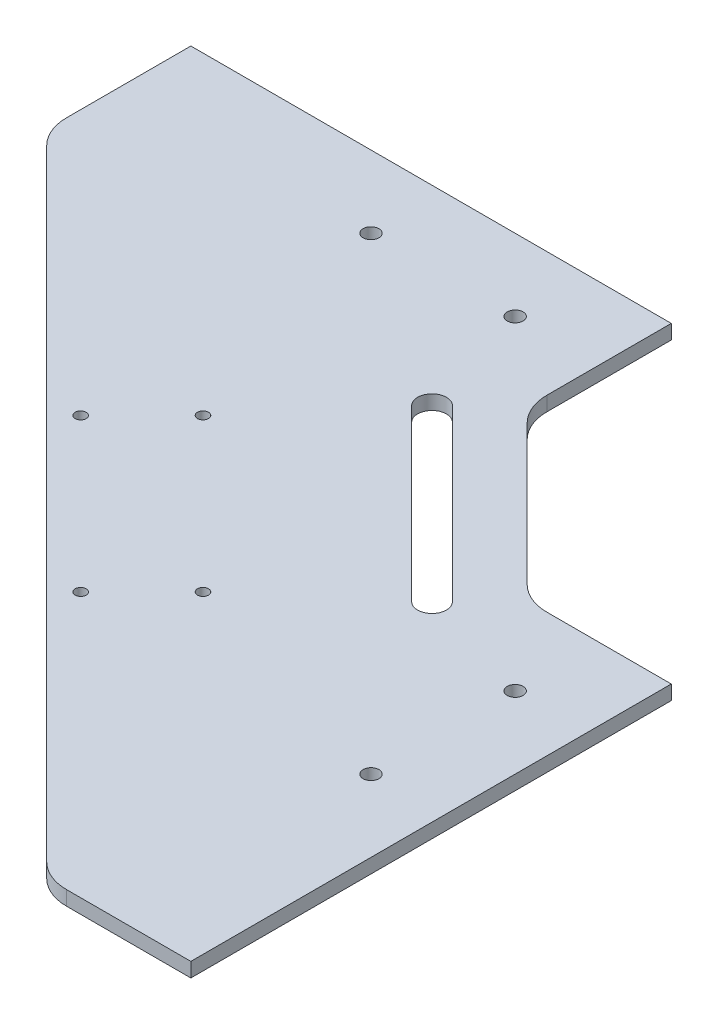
ISO-10303-21;
HEADER;
FILE_DESCRIPTION(('STEP AP214'),'2;1');
FILE_NAME('part.step','',(''),(''),'','','');
FILE_SCHEMA(('AUTOMOTIVE_DESIGN { 1 0 10303 214 1 1 1 1 }'));
ENDSEC;
DATA;
#1=APPLICATION_CONTEXT('core data for automotive mechanical design processes');
#2=APPLICATION_PROTOCOL_DEFINITION('international standard','automotive_design',2000,#1);
#3=PRODUCT_CONTEXT('',#1,'mechanical');
#4=PRODUCT('Part','Part','',(#3));
#5=PRODUCT_RELATED_PRODUCT_CATEGORY('part','',(#4));
#6=PRODUCT_DEFINITION_FORMATION('','',#4);
#7=PRODUCT_DEFINITION_CONTEXT('part definition',#1,'design');
#8=PRODUCT_DEFINITION('design','',#6,#7);
#9=PRODUCT_DEFINITION_SHAPE('','',#8);
#10=(LENGTH_UNIT() NAMED_UNIT(*) SI_UNIT(.MILLI.,.METRE.));
#11=(NAMED_UNIT(*) PLANE_ANGLE_UNIT() SI_UNIT($,.RADIAN.));
#12=(NAMED_UNIT(*) SI_UNIT($,.STERADIAN.) SOLID_ANGLE_UNIT());
#13=UNCERTAINTY_MEASURE_WITH_UNIT(LENGTH_MEASURE(1.E-05),#10,'distance_accuracy_value','');
#14=(GEOMETRIC_REPRESENTATION_CONTEXT(3) GLOBAL_UNCERTAINTY_ASSIGNED_CONTEXT((#13)) GLOBAL_UNIT_ASSIGNED_CONTEXT((#10,
#11,#12)) REPRESENTATION_CONTEXT('',''));
#15=CARTESIAN_POINT('',(0.,0.,0.));
#16=DIRECTION('',(0.,0.,1.));
#17=DIRECTION('',(1.,0.,0.));
#18=AXIS2_PLACEMENT_3D('',#15,#16,#17);
#19=CARTESIAN_POINT('',(-77.198484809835,0.,11.8431457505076));
#20=DIRECTION('',(-0.707106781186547,0.,0.707106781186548));
#21=DIRECTION('',(0.,1.,0.));
#22=AXIS2_PLACEMENT_3D('',#19,#20,#21);
#23=PLANE('',#22);
#24=DIRECTION('',(0.707106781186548,0.,0.707106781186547));
#25=VECTOR('',#24,1.);
#26=CARTESIAN_POINT('',(-77.198484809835,3.,11.8431457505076));
#27=LINE('',#26,#25);
#28=CARTESIAN_POINT('',(-77.198484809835,3.,11.8431457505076));
#29=VERTEX_POINT('',#28);
#30=CARTESIAN_POINT('',(-41.8431457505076,3.,47.198484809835));
#31=VERTEX_POINT('',#30);
#32=EDGE_CURVE('E166',#29,#31,#27,.T.);
#33=ORIENTED_EDGE('',*,*,#32,.T.);
#34=DIRECTION('',(0.,1.,0.));
#35=VECTOR('',#34,1.);
#36=CARTESIAN_POINT('',(-41.8431457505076,0.,47.198484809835));
#37=LINE('',#36,#35);
#38=CARTESIAN_POINT('',(-41.8431457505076,0.,47.198484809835));
#39=VERTEX_POINT('',#38);
#40=EDGE_CURVE('E11',#39,#31,#37,.T.);
#41=ORIENTED_EDGE('',*,*,#40,.F.);
#42=DIRECTION('',(0.707106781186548,0.,0.707106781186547));
#43=VECTOR('',#42,1.);
#44=CARTESIAN_POINT('',(-77.198484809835,0.,11.8431457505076));
#45=LINE('',#44,#43);
#46=CARTESIAN_POINT('',(-77.198484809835,0.,11.8431457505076));
#47=VERTEX_POINT('',#46);
#48=EDGE_CURVE('E202',#47,#39,#45,.T.);
#49=ORIENTED_EDGE('',*,*,#48,.F.);
#50=DIRECTION('',(0.,1.,0.));
#51=VECTOR('',#50,1.);
#52=CARTESIAN_POINT('',(-77.198484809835,0.,11.8431457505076));
#53=LINE('',#52,#51);
#54=EDGE_CURVE('E20',#47,#29,#53,.T.);
#55=ORIENTED_EDGE('',*,*,#54,.T.);
#56=EDGE_LOOP('',(#33,#41,#49,#55));
#57=FACE_BOUND('',#56,.T.);
#58=ADVANCED_FACE('F17',(#57),#23,.F.);
#59=CARTESIAN_POINT('',(-72.9558441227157,0.,7.60050506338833));
#60=DIRECTION('',(0.707106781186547,0.,-0.707106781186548));
#61=DIRECTION('',(0.,-1.,0.));
#62=AXIS2_PLACEMENT_3D('',#59,#60,#61);
#63=PLANE('',#62);
#64=DIRECTION('',(-0.707106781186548,0.,-0.707106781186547));
#65=VECTOR('',#64,1.);
#66=CARTESIAN_POINT('',(-72.9558441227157,3.,7.60050506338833));
#67=LINE('',#66,#65);
#68=CARTESIAN_POINT('',(-37.6005050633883,3.,42.9558441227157));
#69=VERTEX_POINT('',#68);
#70=CARTESIAN_POINT('',(-72.9558441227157,3.,7.60050506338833));
#71=VERTEX_POINT('',#70);
#72=EDGE_CURVE('E168',#69,#71,#67,.T.);
#73=ORIENTED_EDGE('',*,*,#72,.T.);
#74=DIRECTION('',(0.,1.,0.));
#75=VECTOR('',#74,1.);
#76=CARTESIAN_POINT('',(-72.9558441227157,0.,7.60050506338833));
#77=LINE('',#76,#75);
#78=CARTESIAN_POINT('',(-72.9558441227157,0.,7.60050506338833));
#79=VERTEX_POINT('',#78);
#80=EDGE_CURVE('E26',#79,#71,#77,.T.);
#81=ORIENTED_EDGE('',*,*,#80,.F.);
#82=DIRECTION('',(-0.707106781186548,0.,-0.707106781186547));
#83=VECTOR('',#82,1.);
#84=CARTESIAN_POINT('',(-72.9558441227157,0.,7.60050506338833));
#85=LINE('',#84,#83);
#86=CARTESIAN_POINT('',(-37.6005050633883,0.,42.9558441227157));
#87=VERTEX_POINT('',#86);
#88=EDGE_CURVE('E198',#87,#79,#85,.T.);
#89=ORIENTED_EDGE('',*,*,#88,.F.);
#90=DIRECTION('',(0.,1.,0.));
#91=VECTOR('',#90,1.);
#92=CARTESIAN_POINT('',(-37.6005050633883,0.,42.9558441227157));
#93=LINE('',#92,#91);
#94=EDGE_CURVE('E171',#87,#69,#93,.T.);
#95=ORIENTED_EDGE('',*,*,#94,.T.);
#96=EDGE_LOOP('',(#73,#81,#89,#95));
#97=FACE_BOUND('',#96,.T.);
#98=ADVANCED_FACE('F484',(#97),#63,.F.);
#99=CARTESIAN_POINT('',(-75.0771644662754,0.,9.72182540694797));
#100=DIRECTION('',(0.,1.,0.));
#101=DIRECTION('',(0.,0.,1.));
#102=AXIS2_PLACEMENT_3D('',#99,#100,#101);
#103=CYLINDRICAL_SURFACE('',#102,3.);
#104=CARTESIAN_POINT('',(-75.0771644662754,3.,9.72182540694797));
#105=DIRECTION('',(0.,1.,0.));
#106=DIRECTION('',(0.,0.,1.));
#107=AXIS2_PLACEMENT_3D('',#104,#105,#106);
#108=CIRCLE('',#107,3.);
#109=EDGE_CURVE('E186',#71,#29,#108,.T.);
#110=ORIENTED_EDGE('',*,*,#109,.T.);
#111=ORIENTED_EDGE('',*,*,#54,.F.);
#112=CARTESIAN_POINT('',(-75.0771644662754,0.,9.72182540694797));
#113=DIRECTION('',(0.,1.,0.));
#114=DIRECTION('',(0.,0.,1.));
#115=AXIS2_PLACEMENT_3D('',#112,#113,#114);
#116=CIRCLE('',#115,3.);
#117=EDGE_CURVE('E199',#79,#47,#116,.T.);
#118=ORIENTED_EDGE('',*,*,#117,.F.);
#119=ORIENTED_EDGE('',*,*,#80,.T.);
#120=EDGE_LOOP('',(#110,#111,#118,#119));
#121=FACE_BOUND('',#120,.T.);
#122=ADVANCED_FACE('F491',(#121),#103,.F.);
#123=CARTESIAN_POINT('',(-155.,3.,-4.14213562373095));
#124=DIRECTION('',(0.,1.,0.));
#125=DIRECTION('',(0.,0.,1.));
#126=AXIS2_PLACEMENT_3D('',#123,#124,#125);
#127=CYLINDRICAL_SURFACE('',#126,10.);
#128=CARTESIAN_POINT('',(-155.,3.,-4.14213562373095));
#129=DIRECTION('',(0.,1.,0.));
#130=DIRECTION('',(0.,0.,1.));
#131=AXIS2_PLACEMENT_3D('',#128,#129,#130);
#132=CIRCLE('',#131,10.);
#133=CARTESIAN_POINT('',(-165.,3.,-4.14213562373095));
#134=VERTEX_POINT('',#133);
#135=CARTESIAN_POINT('',(-162.071067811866,3.,2.92893218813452));
#136=VERTEX_POINT('',#135);
#137=EDGE_CURVE('E369',#134,#136,#132,.T.);
#138=ORIENTED_EDGE('',*,*,#137,.F.);
#139=DIRECTION('',(0.,1.,0.));
#140=VECTOR('',#139,1.);
#141=CARTESIAN_POINT('',(-165.,3.,-4.14213562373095));
#142=LINE('',#141,#140);
#143=CARTESIAN_POINT('',(-165.,0.,-4.14213562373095));
#144=VERTEX_POINT('',#143);
#145=EDGE_CURVE('E222',#144,#134,#142,.T.);
#146=ORIENTED_EDGE('',*,*,#145,.F.);
#147=CARTESIAN_POINT('',(-155.,0.,-4.14213562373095));
#148=DIRECTION('',(0.,-1.,0.));
#149=DIRECTION('',(0.,0.,1.));
#150=AXIS2_PLACEMENT_3D('',#147,#148,#149);
#151=CIRCLE('',#150,10.);
#152=CARTESIAN_POINT('',(-162.071067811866,0.,2.92893218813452));
#153=VERTEX_POINT('',#152);
#154=EDGE_CURVE('E184',#153,#144,#151,.T.);
#155=ORIENTED_EDGE('',*,*,#154,.F.);
#156=DIRECTION('',(0.,-1.,0.));
#157=VECTOR('',#156,1.);
#158=CARTESIAN_POINT('',(-162.071067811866,0.,2.92893218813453));
#159=LINE('',#158,#157);
#160=EDGE_CURVE('E244',#136,#153,#159,.T.);
#161=ORIENTED_EDGE('',*,*,#160,.F.);
#162=EDGE_LOOP('',(#138,#146,#155,#161));
#163=FACE_BOUND('',#162,.T.);
#164=ADVANCED_FACE('F433',(#163),#127,.T.);
#165=CARTESIAN_POINT('',(-25.857864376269,3.,125.));
#166=DIRECTION('',(0.,1.,0.));
#167=DIRECTION('',(0.,0.,1.));
#168=AXIS2_PLACEMENT_3D('',#165,#166,#167);
#169=CYLINDRICAL_SURFACE('',#168,10.);
#170=CARTESIAN_POINT('',(-25.857864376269,3.,125.));
#171=DIRECTION('',(0.,1.,0.));
#172=DIRECTION('',(0.,0.,1.));
#173=AXIS2_PLACEMENT_3D('',#170,#171,#172);
#174=CIRCLE('',#173,10.);
#175=CARTESIAN_POINT('',(-32.9289321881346,3.,132.071067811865));
#176=VERTEX_POINT('',#175);
#177=CARTESIAN_POINT('',(-25.857864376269,3.,135.));
#178=VERTEX_POINT('',#177);
#179=EDGE_CURVE('E190',#176,#178,#174,.T.);
#180=ORIENTED_EDGE('',*,*,#179,.F.);
#181=DIRECTION('',(0.,1.,0.));
#182=VECTOR('',#181,1.);
#183=CARTESIAN_POINT('',(-32.9289321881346,3.,132.071067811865));
#184=LINE('',#183,#182);
#185=CARTESIAN_POINT('',(-32.9289321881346,0.,132.071067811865));
#186=VERTEX_POINT('',#185);
#187=EDGE_CURVE('E235',#186,#176,#184,.T.);
#188=ORIENTED_EDGE('',*,*,#187,.F.);
#189=CARTESIAN_POINT('',(-25.857864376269,0.,125.));
#190=DIRECTION('',(0.,-1.,0.));
#191=DIRECTION('',(0.,0.,1.));
#192=AXIS2_PLACEMENT_3D('',#189,#190,#191);
#193=CIRCLE('',#192,10.);
#194=CARTESIAN_POINT('',(-25.857864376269,0.,135.));
#195=VERTEX_POINT('',#194);
#196=EDGE_CURVE('E177',#195,#186,#193,.T.);
#197=ORIENTED_EDGE('',*,*,#196,.F.);
#198=DIRECTION('',(0.,-1.,0.));
#199=VECTOR('',#198,1.);
#200=CARTESIAN_POINT('',(-25.857864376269,0.,135.));
#201=LINE('',#200,#199);
#202=EDGE_CURVE('E252',#178,#195,#201,.T.);
#203=ORIENTED_EDGE('',*,*,#202,.F.);
#204=EDGE_LOOP('',(#180,#188,#197,#203));
#205=FACE_BOUND('',#204,.T.);
#206=ADVANCED_FACE('F443',(#205),#169,.T.);
#207=CARTESIAN_POINT('',(-25.8578643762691,3.,25.));
#208=DIRECTION('',(0.,1.,0.));
#209=DIRECTION('',(0.,0.,1.));
#210=AXIS2_PLACEMENT_3D('',#207,#208,#209);
#211=CYLINDRICAL_SURFACE('',#210,10.);
#212=CARTESIAN_POINT('',(-25.8578643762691,3.,25.));
#213=DIRECTION('',(0.,-1.,0.));
#214=DIRECTION('',(0.,0.,1.));
#215=AXIS2_PLACEMENT_3D('',#212,#213,#214);
#216=CIRCLE('',#215,10.);
#217=CARTESIAN_POINT('',(-25.8578643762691,3.,35.));
#218=VERTEX_POINT('',#217);
#219=CARTESIAN_POINT('',(-32.9289321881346,3.,32.0710678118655));
#220=VERTEX_POINT('',#219);
#221=EDGE_CURVE('E287',#218,#220,#216,.T.);
#222=ORIENTED_EDGE('',*,*,#221,.F.);
#223=DIRECTION('',(0.,1.,0.));
#224=VECTOR('',#223,1.);
#225=CARTESIAN_POINT('',(-25.8578643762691,3.,35.));
#226=LINE('',#225,#224);
#227=CARTESIAN_POINT('',(-25.8578643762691,0.,35.));
#228=VERTEX_POINT('',#227);
#229=EDGE_CURVE('E253',#228,#218,#226,.T.);
#230=ORIENTED_EDGE('',*,*,#229,.F.);
#231=CARTESIAN_POINT('',(-25.8578643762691,0.,25.));
#232=DIRECTION('',(0.,1.,0.));
#233=DIRECTION('',(0.,0.,1.));
#234=AXIS2_PLACEMENT_3D('',#231,#232,#233);
#235=CIRCLE('',#234,10.);
#236=CARTESIAN_POINT('',(-32.9289321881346,0.,32.0710678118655));
#237=VERTEX_POINT('',#236);
#238=EDGE_CURVE('E195',#237,#228,#235,.T.);
#239=ORIENTED_EDGE('',*,*,#238,.F.);
#240=DIRECTION('',(0.,-1.,0.));
#241=VECTOR('',#240,1.);
#242=CARTESIAN_POINT('',(-32.9289321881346,0.,32.0710678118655));
#243=LINE('',#242,#241);
#244=EDGE_CURVE('E285',#220,#237,#243,.T.);
#245=ORIENTED_EDGE('',*,*,#244,.F.);
#246=EDGE_LOOP('',(#222,#230,#239,#245));
#247=FACE_BOUND('',#246,.T.);
#248=ADVANCED_FACE('F512',(#247),#211,.F.);
#249=CARTESIAN_POINT('',(-55.,3.,-4.14213562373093));
#250=DIRECTION('',(0.,1.,0.));
#251=DIRECTION('',(0.,0.,1.));
#252=AXIS2_PLACEMENT_3D('',#249,#250,#251);
#253=CYLINDRICAL_SURFACE('',#252,10.);
#254=CARTESIAN_POINT('',(-55.,3.,-4.14213562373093));
#255=DIRECTION('',(0.,-1.,0.));
#256=DIRECTION('',(0.,0.,1.));
#257=AXIS2_PLACEMENT_3D('',#254,#255,#256);
#258=CIRCLE('',#257,10.);
#259=CARTESIAN_POINT('',(-62.0710678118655,3.,2.92893218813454));
#260=VERTEX_POINT('',#259);
#261=CARTESIAN_POINT('',(-65.,3.,-4.14213562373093));
#262=VERTEX_POINT('',#261);
#263=EDGE_CURVE('E290',#260,#262,#258,.T.);
#264=ORIENTED_EDGE('',*,*,#263,.F.);
#265=DIRECTION('',(0.,1.,0.));
#266=VECTOR('',#265,1.);
#267=CARTESIAN_POINT('',(-62.0710678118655,3.,2.92893218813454));
#268=LINE('',#267,#266);
#269=CARTESIAN_POINT('',(-62.0710678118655,0.,2.92893218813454));
#270=VERTEX_POINT('',#269);
#271=EDGE_CURVE('E278',#270,#260,#268,.T.);
#272=ORIENTED_EDGE('',*,*,#271,.F.);
#273=CARTESIAN_POINT('',(-55.,0.,-4.14213562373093));
#274=DIRECTION('',(0.,1.,0.));
#275=DIRECTION('',(0.,0.,1.));
#276=AXIS2_PLACEMENT_3D('',#273,#274,#275);
#277=CIRCLE('',#276,10.);
#278=CARTESIAN_POINT('',(-65.,0.,-4.14213562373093));
#279=VERTEX_POINT('',#278);
#280=EDGE_CURVE('E194',#279,#270,#277,.T.);
#281=ORIENTED_EDGE('',*,*,#280,.F.);
#282=DIRECTION('',(0.,-1.,0.));
#283=VECTOR('',#282,1.);
#284=CARTESIAN_POINT('',(-65.,0.,-4.14213562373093));
#285=LINE('',#284,#283);
#286=EDGE_CURVE('E298',#262,#279,#285,.T.);
#287=ORIENTED_EDGE('',*,*,#286,.F.);
#288=EDGE_LOOP('',(#264,#272,#281,#287));
#289=FACE_BOUND('',#288,.T.);
#290=ADVANCED_FACE('F327',(#289),#253,.F.);
#291=CARTESIAN_POINT('',(0.,0.,0.));
#292=DIRECTION('',(0.,1.,0.));
#293=DIRECTION('',(1.,0.,0.));
#294=AXIS2_PLACEMENT_3D('',#291,#292,#293);
#295=PLANE('',#294);
#296=CARTESIAN_POINT('',(-15.,0.,52.5));
#297=DIRECTION('',(0.,1.,0.));
#298=DIRECTION('',(0.,0.,1.));
#299=AXIS2_PLACEMENT_3D('',#296,#297,#298);
#300=CIRCLE('',#299,1.65);
#301=CARTESIAN_POINT('',(-15.,0.,54.15));
#302=VERTEX_POINT('',#301);
#303=EDGE_CURVE('E388',#302,#302,#300,.T.);
#304=ORIENTED_EDGE('',*,*,#303,.T.);
#305=EDGE_LOOP('',(#304));
#306=FACE_BOUND('',#305,.T.);
#307=CARTESIAN_POINT('',(-15.,0.,82.5));
#308=DIRECTION('',(0.,1.,0.));
#309=DIRECTION('',(0.,0.,1.));
#310=AXIS2_PLACEMENT_3D('',#307,#308,#309);
#311=CIRCLE('',#310,1.65);
#312=CARTESIAN_POINT('',(-15.,0.,84.15));
#313=VERTEX_POINT('',#312);
#314=EDGE_CURVE('E223',#313,#313,#311,.T.);
#315=ORIENTED_EDGE('',*,*,#314,.T.);
#316=EDGE_LOOP('',(#315));
#317=FACE_BOUND('',#316,.T.);
#318=CARTESIAN_POINT('',(-82.5,0.,-15.));
#319=DIRECTION('',(0.,1.,0.));
#320=DIRECTION('',(0.,0.,1.));
#321=AXIS2_PLACEMENT_3D('',#318,#319,#320);
#322=CIRCLE('',#321,1.65);
#323=CARTESIAN_POINT('',(-82.5,0.,-13.35));
#324=VERTEX_POINT('',#323);
#325=EDGE_CURVE('E216',#324,#324,#322,.T.);
#326=ORIENTED_EDGE('',*,*,#325,.T.);
#327=EDGE_LOOP('',(#326));
#328=FACE_BOUND('',#327,.T.);
#329=CARTESIAN_POINT('',(-112.5,0.,-15.));
#330=DIRECTION('',(0.,1.,0.));
#331=DIRECTION('',(0.,0.,1.));
#332=AXIS2_PLACEMENT_3D('',#329,#330,#331);
#333=CIRCLE('',#332,1.65);
#334=CARTESIAN_POINT('',(-112.5,0.,-13.35));
#335=VERTEX_POINT('',#334);
#336=EDGE_CURVE('E398',#335,#335,#333,.T.);
#337=ORIENTED_EDGE('',*,*,#336,.T.);
#338=EDGE_LOOP('',(#337));
#339=FACE_BOUND('',#338,.T.);
#340=ORIENTED_EDGE('',*,*,#88,.T.);
#341=ORIENTED_EDGE('',*,*,#117,.T.);
#342=ORIENTED_EDGE('',*,*,#48,.T.);
#343=CARTESIAN_POINT('',(-39.721825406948,0.,45.0771644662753));
#344=DIRECTION('',(0.,1.,0.));
#345=DIRECTION('',(0.,0.,1.));
#346=AXIS2_PLACEMENT_3D('',#343,#344,#345);
#347=CIRCLE('',#346,3.);
#348=EDGE_CURVE('E39',#39,#87,#347,.T.);
#349=ORIENTED_EDGE('',*,*,#348,.T.);
#350=EDGE_LOOP('',(#340,#341,#342,#349));
#351=FACE_BOUND('',#350,.T.);
#352=CARTESIAN_POINT('',(-97.1464466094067,0.,35.3266414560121));
#353=DIRECTION('',(0.,1.,0.));
#354=DIRECTION('',(0.,0.,1.));
#355=AXIS2_PLACEMENT_3D('',#352,#353,#354);
#356=CIRCLE('',#355,1.15000000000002);
#357=CARTESIAN_POINT('',(-97.1464466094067,0.,36.4766414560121));
#358=VERTEX_POINT('',#357);
#359=EDGE_CURVE('E378',#358,#358,#356,.T.);
#360=ORIENTED_EDGE('',*,*,#359,.T.);
#361=EDGE_LOOP('',(#360));
#362=FACE_BOUND('',#361,.T.);
#363=CARTESIAN_POINT('',(-65.3266414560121,0.,67.1464466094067));
#364=DIRECTION('',(0.,1.,0.));
#365=DIRECTION('',(0.,0.,1.));
#366=AXIS2_PLACEMENT_3D('',#363,#364,#365);
#367=CIRCLE('',#366,1.14999999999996);
#368=CARTESIAN_POINT('',(-65.3266414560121,0.,68.2964466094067));
#369=VERTEX_POINT('',#368);
#370=EDGE_CURVE('E340',#369,#369,#367,.T.);
#371=ORIENTED_EDGE('',*,*,#370,.T.);
#372=EDGE_LOOP('',(#371));
#373=FACE_BOUND('',#372,.T.);
#374=CARTESIAN_POINT('',(-78.05456351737,0.,79.8743686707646));
#375=DIRECTION('',(0.,1.,0.));
#376=DIRECTION('',(0.,0.,1.));
#377=AXIS2_PLACEMENT_3D('',#374,#375,#376);
#378=CIRCLE('',#377,1.14999999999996);
#379=CARTESIAN_POINT('',(-78.05456351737,0.,81.0243686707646));
#380=VERTEX_POINT('',#379);
#381=EDGE_CURVE('E346',#380,#380,#378,.T.);
#382=ORIENTED_EDGE('',*,*,#381,.T.);
#383=EDGE_LOOP('',(#382));
#384=FACE_BOUND('',#383,.T.);
#385=CARTESIAN_POINT('',(-109.874368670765,0.,48.0545635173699));
#386=DIRECTION('',(0.,1.,0.));
#387=DIRECTION('',(0.,0.,1.));
#388=AXIS2_PLACEMENT_3D('',#385,#386,#387);
#389=CIRCLE('',#388,1.15);
#390=CARTESIAN_POINT('',(-109.874368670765,0.,49.2045635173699));
#391=VERTEX_POINT('',#390);
#392=EDGE_CURVE('E338',#391,#391,#389,.T.);
#393=ORIENTED_EDGE('',*,*,#392,.T.);
#394=EDGE_LOOP('',(#393));
#395=FACE_BOUND('',#394,.T.);
#396=DIRECTION('',(-1.,0.,0.));
#397=VECTOR('',#396,1.);
#398=CARTESIAN_POINT('',(0.,0.,135.));
#399=LINE('',#398,#397);
#400=CARTESIAN_POINT('',(0.,0.,135.));
#401=VERTEX_POINT('',#400);
#402=EDGE_CURVE('E259',#401,#195,#399,.T.);
#403=ORIENTED_EDGE('',*,*,#402,.T.);
#404=ORIENTED_EDGE('',*,*,#196,.T.);
#405=DIRECTION('',(0.707106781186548,0.,0.707106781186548));
#406=VECTOR('',#405,1.);
#407=CARTESIAN_POINT('',(-82.5,0.,82.5));
#408=LINE('',#407,#406);
#409=EDGE_CURVE('E232',#153,#186,#408,.T.);
#410=ORIENTED_EDGE('',*,*,#409,.F.);
#411=ORIENTED_EDGE('',*,*,#154,.T.);
#412=DIRECTION('',(0.,0.,-1.));
#413=VECTOR('',#412,1.);
#414=CARTESIAN_POINT('',(-165.,0.,0.));
#415=LINE('',#414,#413);
#416=CARTESIAN_POINT('',(-165.,0.,-30.));
#417=VERTEX_POINT('',#416);
#418=EDGE_CURVE('E218',#144,#417,#415,.T.);
#419=ORIENTED_EDGE('',*,*,#418,.T.);
#420=DIRECTION('',(-1.,0.,0.));
#421=VECTOR('',#420,1.);
#422=CARTESIAN_POINT('',(0.,0.,-30.));
#423=LINE('',#422,#421);
#424=CARTESIAN_POINT('',(-65.,0.,-30.));
#425=VERTEX_POINT('',#424);
#426=EDGE_CURVE('E310',#425,#417,#423,.T.);
#427=ORIENTED_EDGE('',*,*,#426,.F.);
#428=DIRECTION('',(0.,0.,1.));
#429=VECTOR('',#428,1.);
#430=CARTESIAN_POINT('',(-65.,0.,0.));
#431=LINE('',#430,#429);
#432=EDGE_CURVE('E302',#425,#279,#431,.T.);
#433=ORIENTED_EDGE('',*,*,#432,.T.);
#434=ORIENTED_EDGE('',*,*,#280,.T.);
#435=DIRECTION('',(0.707106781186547,0.,0.707106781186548));
#436=VECTOR('',#435,1.);
#437=CARTESIAN_POINT('',(-32.5,0.,32.5));
#438=LINE('',#437,#436);
#439=EDGE_CURVE('E277',#270,#237,#438,.T.);
#440=ORIENTED_EDGE('',*,*,#439,.T.);
#441=ORIENTED_EDGE('',*,*,#238,.T.);
#442=DIRECTION('',(1.,0.,0.));
#443=VECTOR('',#442,1.);
#444=CARTESIAN_POINT('',(0.,0.,35.));
#445=LINE('',#444,#443);
#446=CARTESIAN_POINT('',(0.,0.,35.));
#447=VERTEX_POINT('',#446);
#448=EDGE_CURVE('E258',#228,#447,#445,.T.);
#449=ORIENTED_EDGE('',*,*,#448,.T.);
#450=DIRECTION('',(0.,0.,1.));
#451=VECTOR('',#450,1.);
#452=CARTESIAN_POINT('',(0.,0.,0.));
#453=LINE('',#452,#451);
#454=EDGE_CURVE('E264',#447,#401,#453,.T.);
#455=ORIENTED_EDGE('',*,*,#454,.T.);
#456=EDGE_LOOP('',(#403,#404,#410,#411,#419,#427,#433,#434,#440,#441,#449,#455));
#457=FACE_BOUND('',#456,.T.);
#458=ADVANCED_FACE('F321',(#306,#317,#328,#339,#351,#362,#373,#384,#395,#457),#295,.F.);
#459=CARTESIAN_POINT('',(0.,3.,0.));
#460=DIRECTION('',(0.,1.,0.));
#461=DIRECTION('',(1.,0.,0.));
#462=AXIS2_PLACEMENT_3D('',#459,#460,#461);
#463=PLANE('',#462);
#464=CARTESIAN_POINT('',(-15.,3.,52.5));
#465=DIRECTION('',(0.,1.,0.));
#466=DIRECTION('',(0.,0.,1.));
#467=AXIS2_PLACEMENT_3D('',#464,#465,#466);
#468=CIRCLE('',#467,1.65);
#469=CARTESIAN_POINT('',(-15.,3.,54.15));
#470=VERTEX_POINT('',#469);
#471=EDGE_CURVE('E385',#470,#470,#468,.T.);
#472=ORIENTED_EDGE('',*,*,#471,.F.);
#473=EDGE_LOOP('',(#472));
#474=FACE_BOUND('',#473,.T.);
#475=CARTESIAN_POINT('',(-15.,3.,82.5));
#476=DIRECTION('',(0.,1.,0.));
#477=DIRECTION('',(0.,0.,1.));
#478=AXIS2_PLACEMENT_3D('',#475,#476,#477);
#479=CIRCLE('',#478,1.65);
#480=CARTESIAN_POINT('',(-15.,3.,84.15));
#481=VERTEX_POINT('',#480);
#482=EDGE_CURVE('E354',#481,#481,#479,.T.);
#483=ORIENTED_EDGE('',*,*,#482,.F.);
#484=EDGE_LOOP('',(#483));
#485=FACE_BOUND('',#484,.T.);
#486=CARTESIAN_POINT('',(-82.5,3.,-15.));
#487=DIRECTION('',(0.,1.,0.));
#488=DIRECTION('',(0.,0.,1.));
#489=AXIS2_PLACEMENT_3D('',#486,#487,#488);
#490=CIRCLE('',#489,1.65);
#491=CARTESIAN_POINT('',(-82.5,3.,-13.35));
#492=VERTEX_POINT('',#491);
#493=EDGE_CURVE('E394',#492,#492,#490,.T.);
#494=ORIENTED_EDGE('',*,*,#493,.F.);
#495=EDGE_LOOP('',(#494));
#496=FACE_BOUND('',#495,.T.);
#497=CARTESIAN_POINT('',(-112.5,3.,-15.));
#498=DIRECTION('',(0.,1.,0.));
#499=DIRECTION('',(0.,0.,1.));
#500=AXIS2_PLACEMENT_3D('',#497,#498,#499);
#501=CIRCLE('',#500,1.65);
#502=CARTESIAN_POINT('',(-112.5,3.,-13.35));
#503=VERTEX_POINT('',#502);
#504=EDGE_CURVE('E404',#503,#503,#501,.T.);
#505=ORIENTED_EDGE('',*,*,#504,.F.);
#506=EDGE_LOOP('',(#505));
#507=FACE_BOUND('',#506,.T.);
#508=ORIENTED_EDGE('',*,*,#109,.F.);
#509=ORIENTED_EDGE('',*,*,#72,.F.);
#510=CARTESIAN_POINT('',(-39.721825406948,3.,45.0771644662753));
#511=DIRECTION('',(0.,1.,0.));
#512=DIRECTION('',(0.,0.,1.));
#513=AXIS2_PLACEMENT_3D('',#510,#511,#512);
#514=CIRCLE('',#513,3.);
#515=EDGE_CURVE('E161',#31,#69,#514,.T.);
#516=ORIENTED_EDGE('',*,*,#515,.F.);
#517=ORIENTED_EDGE('',*,*,#32,.F.);
#518=EDGE_LOOP('',(#508,#509,#516,#517));
#519=FACE_BOUND('',#518,.T.);
#520=CARTESIAN_POINT('',(-97.1464466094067,3.,35.3266414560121));
#521=DIRECTION('',(0.,1.,0.));
#522=DIRECTION('',(0.,0.,1.));
#523=AXIS2_PLACEMENT_3D('',#520,#521,#522);
#524=CIRCLE('',#523,1.15000000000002);
#525=CARTESIAN_POINT('',(-97.1464466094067,3.,36.4766414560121));
#526=VERTEX_POINT('',#525);
#527=EDGE_CURVE('E379',#526,#526,#524,.T.);
#528=ORIENTED_EDGE('',*,*,#527,.F.);
#529=EDGE_LOOP('',(#528));
#530=FACE_BOUND('',#529,.T.);
#531=CARTESIAN_POINT('',(-65.3266414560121,3.,67.1464466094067));
#532=DIRECTION('',(0.,1.,0.));
#533=DIRECTION('',(0.,0.,1.));
#534=AXIS2_PLACEMENT_3D('',#531,#532,#533);
#535=CIRCLE('',#534,1.14999999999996);
#536=CARTESIAN_POINT('',(-65.3266414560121,3.,68.2964466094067));
#537=VERTEX_POINT('',#536);
#538=EDGE_CURVE('E344',#537,#537,#535,.T.);
#539=ORIENTED_EDGE('',*,*,#538,.F.);
#540=EDGE_LOOP('',(#539));
#541=FACE_BOUND('',#540,.T.);
#542=CARTESIAN_POINT('',(-78.05456351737,3.,79.8743686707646));
#543=DIRECTION('',(0.,1.,0.));
#544=DIRECTION('',(0.,0.,1.));
#545=AXIS2_PLACEMENT_3D('',#542,#543,#544);
#546=CIRCLE('',#545,1.14999999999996);
#547=CARTESIAN_POINT('',(-78.05456351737,3.,81.0243686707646));
#548=VERTEX_POINT('',#547);
#549=EDGE_CURVE('E345',#548,#548,#546,.T.);
#550=ORIENTED_EDGE('',*,*,#549,.F.);
#551=EDGE_LOOP('',(#550));
#552=FACE_BOUND('',#551,.T.);
#553=CARTESIAN_POINT('',(-109.874368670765,3.,48.0545635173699));
#554=DIRECTION('',(0.,1.,0.));
#555=DIRECTION('',(0.,0.,1.));
#556=AXIS2_PLACEMENT_3D('',#553,#554,#555);
#557=CIRCLE('',#556,1.15);
#558=CARTESIAN_POINT('',(-109.874368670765,3.,49.2045635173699));
#559=VERTEX_POINT('',#558);
#560=EDGE_CURVE('E350',#559,#559,#557,.T.);
#561=ORIENTED_EDGE('',*,*,#560,.F.);
#562=EDGE_LOOP('',(#561));
#563=FACE_BOUND('',#562,.T.);
#564=DIRECTION('',(0.707106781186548,0.,0.707106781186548));
#565=VECTOR('',#564,1.);
#566=CARTESIAN_POINT('',(-82.5,3.,82.5));
#567=LINE('',#566,#565);
#568=EDGE_CURVE('E240',#136,#176,#567,.T.);
#569=ORIENTED_EDGE('',*,*,#568,.T.);
#570=ORIENTED_EDGE('',*,*,#179,.T.);
#571=DIRECTION('',(-1.,0.,0.));
#572=VECTOR('',#571,1.);
#573=CARTESIAN_POINT('',(0.,3.,135.));
#574=LINE('',#573,#572);
#575=CARTESIAN_POINT('',(0.,3.,135.));
#576=VERTEX_POINT('',#575);
#577=EDGE_CURVE('E248',#576,#178,#574,.T.);
#578=ORIENTED_EDGE('',*,*,#577,.F.);
#579=DIRECTION('',(0.,0.,1.));
#580=VECTOR('',#579,1.);
#581=CARTESIAN_POINT('',(0.,3.,0.));
#582=LINE('',#581,#580);
#583=CARTESIAN_POINT('',(0.,3.,35.));
#584=VERTEX_POINT('',#583);
#585=EDGE_CURVE('E272',#584,#576,#582,.T.);
#586=ORIENTED_EDGE('',*,*,#585,.F.);
#587=DIRECTION('',(1.,0.,0.));
#588=VECTOR('',#587,1.);
#589=CARTESIAN_POINT('',(0.,3.,35.));
#590=LINE('',#589,#588);
#591=EDGE_CURVE('E257',#218,#584,#590,.T.);
#592=ORIENTED_EDGE('',*,*,#591,.F.);
#593=ORIENTED_EDGE('',*,*,#221,.T.);
#594=DIRECTION('',(0.707106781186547,0.,0.707106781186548));
#595=VECTOR('',#594,1.);
#596=CARTESIAN_POINT('',(-32.5,3.,32.5));
#597=LINE('',#596,#595);
#598=EDGE_CURVE('E282',#260,#220,#597,.T.);
#599=ORIENTED_EDGE('',*,*,#598,.F.);
#600=ORIENTED_EDGE('',*,*,#263,.T.);
#601=DIRECTION('',(0.,0.,1.));
#602=VECTOR('',#601,1.);
#603=CARTESIAN_POINT('',(-65.,3.,0.));
#604=LINE('',#603,#602);
#605=CARTESIAN_POINT('',(-65.,3.,-30.));
#606=VERTEX_POINT('',#605);
#607=EDGE_CURVE('E294',#606,#262,#604,.T.);
#608=ORIENTED_EDGE('',*,*,#607,.F.);
#609=DIRECTION('',(-1.,0.,0.));
#610=VECTOR('',#609,1.);
#611=CARTESIAN_POINT('',(0.,3.,-30.));
#612=LINE('',#611,#610);
#613=CARTESIAN_POINT('',(-165.,3.,-30.));
#614=VERTEX_POINT('',#613);
#615=EDGE_CURVE('E313',#606,#614,#612,.T.);
#616=ORIENTED_EDGE('',*,*,#615,.T.);
#617=DIRECTION('',(0.,0.,-1.));
#618=VECTOR('',#617,1.);
#619=CARTESIAN_POINT('',(-165.,3.,0.));
#620=LINE('',#619,#618);
#621=EDGE_CURVE('E227',#134,#614,#620,.T.);
#622=ORIENTED_EDGE('',*,*,#621,.F.);
#623=ORIENTED_EDGE('',*,*,#137,.T.);
#624=EDGE_LOOP('',(#569,#570,#578,#586,#592,#593,#599,#600,#608,#616,#622,#623));
#625=FACE_BOUND('',#624,.T.);
#626=ADVANCED_FACE('F163',(#474,#485,#496,#507,#519,#530,#541,#552,#563,#625),#463,.T.);
#627=CARTESIAN_POINT('',(0.,3.,-30.));
#628=DIRECTION('',(0.,0.,1.));
#629=DIRECTION('',(1.,0.,0.));
#630=AXIS2_PLACEMENT_3D('',#627,#628,#629);
#631=PLANE('',#630);
#632=ORIENTED_EDGE('',*,*,#426,.T.);
#633=DIRECTION('',(0.,-1.,0.));
#634=VECTOR('',#633,1.);
#635=CARTESIAN_POINT('',(-165.,3.,-30.));
#636=LINE('',#635,#634);
#637=EDGE_CURVE('E228',#614,#417,#636,.T.);
#638=ORIENTED_EDGE('',*,*,#637,.F.);
#639=ORIENTED_EDGE('',*,*,#615,.F.);
#640=DIRECTION('',(0.,-1.,0.));
#641=VECTOR('',#640,1.);
#642=CARTESIAN_POINT('',(-65.,3.,-30.));
#643=LINE('',#642,#641);
#644=EDGE_CURVE('E306',#606,#425,#643,.T.);
#645=ORIENTED_EDGE('',*,*,#644,.T.);
#646=EDGE_LOOP('',(#632,#638,#639,#645));
#647=FACE_BOUND('',#646,.T.);
#648=ADVANCED_FACE('F428',(#647),#631,.F.);
#649=CARTESIAN_POINT('',(-65.,3.,0.));
#650=DIRECTION('',(1.,0.,0.));
#651=DIRECTION('',(0.,1.,0.));
#652=AXIS2_PLACEMENT_3D('',#649,#650,#651);
#653=PLANE('',#652);
#654=ORIENTED_EDGE('',*,*,#607,.T.);
#655=ORIENTED_EDGE('',*,*,#286,.T.);
#656=ORIENTED_EDGE('',*,*,#432,.F.);
#657=ORIENTED_EDGE('',*,*,#644,.F.);
#658=EDGE_LOOP('',(#654,#655,#656,#657));
#659=FACE_BOUND('',#658,.T.);
#660=ADVANCED_FACE('F543',(#659),#653,.T.);
#661=CARTESIAN_POINT('',(-32.5,3.,32.5));
#662=DIRECTION('',(0.707106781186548,0.,-0.707106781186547));
#663=DIRECTION('',(0.,-1.,0.));
#664=AXIS2_PLACEMENT_3D('',#661,#662,#663);
#665=PLANE('',#664);
#666=ORIENTED_EDGE('',*,*,#439,.F.);
#667=ORIENTED_EDGE('',*,*,#271,.T.);
#668=ORIENTED_EDGE('',*,*,#598,.T.);
#669=ORIENTED_EDGE('',*,*,#244,.T.);
#670=EDGE_LOOP('',(#666,#667,#668,#669));
#671=FACE_BOUND('',#670,.T.);
#672=ADVANCED_FACE('F330',(#671),#665,.T.);
#673=CARTESIAN_POINT('',(0.,3.,35.));
#674=DIRECTION('',(0.,0.,-1.));
#675=DIRECTION('',(0.,-1.,0.));
#676=AXIS2_PLACEMENT_3D('',#673,#674,#675);
#677=PLANE('',#676);
#678=ORIENTED_EDGE('',*,*,#448,.F.);
#679=ORIENTED_EDGE('',*,*,#229,.T.);
#680=ORIENTED_EDGE('',*,*,#591,.T.);
#681=DIRECTION('',(0.,-1.,0.));
#682=VECTOR('',#681,1.);
#683=CARTESIAN_POINT('',(0.,3.,35.));
#684=LINE('',#683,#682);
#685=EDGE_CURVE('E268',#584,#447,#684,.T.);
#686=ORIENTED_EDGE('',*,*,#685,.T.);
#687=EDGE_LOOP('',(#678,#679,#680,#686));
#688=FACE_BOUND('',#687,.T.);
#689=ADVANCED_FACE('F559',(#688),#677,.T.);
#690=CARTESIAN_POINT('',(0.,3.,0.));
#691=DIRECTION('',(1.,0.,0.));
#692=DIRECTION('',(0.,0.,1.));
#693=AXIS2_PLACEMENT_3D('',#690,#691,#692);
#694=PLANE('',#693);
#695=ORIENTED_EDGE('',*,*,#454,.F.);
#696=ORIENTED_EDGE('',*,*,#685,.F.);
#697=ORIENTED_EDGE('',*,*,#585,.T.);
#698=DIRECTION('',(0.,-1.,0.));
#699=VECTOR('',#698,1.);
#700=CARTESIAN_POINT('',(0.,3.,135.));
#701=LINE('',#700,#699);
#702=EDGE_CURVE('E263',#576,#401,#701,.T.);
#703=ORIENTED_EDGE('',*,*,#702,.T.);
#704=EDGE_LOOP('',(#695,#696,#697,#703));
#705=FACE_BOUND('',#704,.T.);
#706=ADVANCED_FACE('F450',(#705),#694,.T.);
#707=CARTESIAN_POINT('',(0.,3.,135.));
#708=DIRECTION('',(0.,0.,1.));
#709=DIRECTION('',(1.,0.,0.));
#710=AXIS2_PLACEMENT_3D('',#707,#708,#709);
#711=PLANE('',#710);
#712=ORIENTED_EDGE('',*,*,#577,.T.);
#713=ORIENTED_EDGE('',*,*,#202,.T.);
#714=ORIENTED_EDGE('',*,*,#402,.F.);
#715=ORIENTED_EDGE('',*,*,#702,.F.);
#716=EDGE_LOOP('',(#712,#713,#714,#715));
#717=FACE_BOUND('',#716,.T.);
#718=ADVANCED_FACE('F447',(#717),#711,.T.);
#719=CARTESIAN_POINT('',(-82.5,3.,82.5));
#720=DIRECTION('',(0.707106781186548,0.,-0.707106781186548));
#721=DIRECTION('',(0.,-1.,0.));
#722=AXIS2_PLACEMENT_3D('',#719,#720,#721);
#723=PLANE('',#722);
#724=ORIENTED_EDGE('',*,*,#409,.T.);
#725=ORIENTED_EDGE('',*,*,#187,.T.);
#726=ORIENTED_EDGE('',*,*,#568,.F.);
#727=ORIENTED_EDGE('',*,*,#160,.T.);
#728=EDGE_LOOP('',(#724,#725,#726,#727));
#729=FACE_BOUND('',#728,.T.);
#730=ADVANCED_FACE('F436',(#729),#723,.F.);
#731=CARTESIAN_POINT('',(-165.,3.,0.));
#732=DIRECTION('',(-1.,0.,0.));
#733=DIRECTION('',(0.,0.,1.));
#734=AXIS2_PLACEMENT_3D('',#731,#732,#733);
#735=PLANE('',#734);
#736=ORIENTED_EDGE('',*,*,#418,.F.);
#737=ORIENTED_EDGE('',*,*,#145,.T.);
#738=ORIENTED_EDGE('',*,*,#621,.T.);
#739=ORIENTED_EDGE('',*,*,#637,.T.);
#740=EDGE_LOOP('',(#736,#737,#738,#739));
#741=FACE_BOUND('',#740,.T.);
#742=ADVANCED_FACE('F420',(#741),#735,.T.);
#743=CARTESIAN_POINT('',(-15.,3.,82.5));
#744=DIRECTION('',(0.,-1.,0.));
#745=DIRECTION('',(0.,0.,-1.));
#746=AXIS2_PLACEMENT_3D('',#743,#744,#745);
#747=CYLINDRICAL_SURFACE('',#746,1.65);
#748=ORIENTED_EDGE('',*,*,#314,.F.);
#749=EDGE_LOOP('',(#748));
#750=FACE_BOUND('',#749,.T.);
#751=ORIENTED_EDGE('',*,*,#482,.T.);
#752=EDGE_LOOP('',(#751));
#753=FACE_BOUND('',#752,.T.);
#754=ADVANCED_FACE('F567',(#750,#753),#747,.F.);
#755=CARTESIAN_POINT('',(-82.5,3.,-15.));
#756=DIRECTION('',(0.,-1.,0.));
#757=DIRECTION('',(0.,0.,-1.));
#758=AXIS2_PLACEMENT_3D('',#755,#756,#757);
#759=CYLINDRICAL_SURFACE('',#758,1.65);
#760=ORIENTED_EDGE('',*,*,#325,.F.);
#761=EDGE_LOOP('',(#760));
#762=FACE_BOUND('',#761,.T.);
#763=ORIENTED_EDGE('',*,*,#493,.T.);
#764=EDGE_LOOP('',(#763));
#765=FACE_BOUND('',#764,.T.);
#766=ADVANCED_FACE('F579',(#762,#765),#759,.F.);
#767=CARTESIAN_POINT('',(-112.5,3.,-15.));
#768=DIRECTION('',(0.,-1.,0.));
#769=DIRECTION('',(0.,0.,-1.));
#770=AXIS2_PLACEMENT_3D('',#767,#768,#769);
#771=CYLINDRICAL_SURFACE('',#770,1.65);
#772=ORIENTED_EDGE('',*,*,#336,.F.);
#773=EDGE_LOOP('',(#772));
#774=FACE_BOUND('',#773,.T.);
#775=ORIENTED_EDGE('',*,*,#504,.T.);
#776=EDGE_LOOP('',(#775));
#777=FACE_BOUND('',#776,.T.);
#778=ADVANCED_FACE('F583',(#774,#777),#771,.F.);
#779=CARTESIAN_POINT('',(-15.,3.,52.5));
#780=DIRECTION('',(0.,-1.,0.));
#781=DIRECTION('',(0.,0.,-1.));
#782=AXIS2_PLACEMENT_3D('',#779,#780,#781);
#783=CYLINDRICAL_SURFACE('',#782,1.65);
#784=ORIENTED_EDGE('',*,*,#303,.F.);
#785=EDGE_LOOP('',(#784));
#786=FACE_BOUND('',#785,.T.);
#787=ORIENTED_EDGE('',*,*,#471,.T.);
#788=EDGE_LOOP('',(#787));
#789=FACE_BOUND('',#788,.T.);
#790=ADVANCED_FACE('F623',(#786,#789),#783,.F.);
#791=CARTESIAN_POINT('',(-39.721825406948,0.,45.0771644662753));
#792=DIRECTION('',(0.,1.,0.));
#793=DIRECTION('',(0.,0.,1.));
#794=AXIS2_PLACEMENT_3D('',#791,#792,#793);
#795=CYLINDRICAL_SURFACE('',#794,3.);
#796=ORIENTED_EDGE('',*,*,#348,.F.);
#797=ORIENTED_EDGE('',*,*,#40,.T.);
#798=ORIENTED_EDGE('',*,*,#515,.T.);
#799=ORIENTED_EDGE('',*,*,#94,.F.);
#800=EDGE_LOOP('',(#796,#797,#798,#799));
#801=FACE_BOUND('',#800,.T.);
#802=ADVANCED_FACE('F173',(#801),#795,.F.);
#803=CARTESIAN_POINT('',(-97.1464466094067,0.,35.3266414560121));
#804=DIRECTION('',(0.,1.,0.));
#805=DIRECTION('',(0.,0.,1.));
#806=AXIS2_PLACEMENT_3D('',#803,#804,#805);
#807=CYLINDRICAL_SURFACE('',#806,1.15000000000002);
#808=ORIENTED_EDGE('',*,*,#527,.T.);
#809=EDGE_LOOP('',(#808));
#810=FACE_BOUND('',#809,.T.);
#811=ORIENTED_EDGE('',*,*,#359,.F.);
#812=EDGE_LOOP('',(#811));
#813=FACE_BOUND('',#812,.T.);
#814=ADVANCED_FACE('F640',(#810,#813),#807,.F.);
#815=CARTESIAN_POINT('',(-65.3266414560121,0.,67.1464466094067));
#816=DIRECTION('',(0.,1.,0.));
#817=DIRECTION('',(0.,0.,1.));
#818=AXIS2_PLACEMENT_3D('',#815,#816,#817);
#819=CYLINDRICAL_SURFACE('',#818,1.14999999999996);
#820=ORIENTED_EDGE('',*,*,#538,.T.);
#821=EDGE_LOOP('',(#820));
#822=FACE_BOUND('',#821,.T.);
#823=ORIENTED_EDGE('',*,*,#370,.F.);
#824=EDGE_LOOP('',(#823));
#825=FACE_BOUND('',#824,.T.);
#826=ADVANCED_FACE('F648',(#822,#825),#819,.F.);
#827=CARTESIAN_POINT('',(-78.05456351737,0.,79.8743686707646));
#828=DIRECTION('',(0.,1.,0.));
#829=DIRECTION('',(0.,0.,1.));
#830=AXIS2_PLACEMENT_3D('',#827,#828,#829);
#831=CYLINDRICAL_SURFACE('',#830,1.14999999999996);
#832=ORIENTED_EDGE('',*,*,#549,.T.);
#833=EDGE_LOOP('',(#832));
#834=FACE_BOUND('',#833,.T.);
#835=ORIENTED_EDGE('',*,*,#381,.F.);
#836=EDGE_LOOP('',(#835));
#837=FACE_BOUND('',#836,.T.);
#838=ADVANCED_FACE('F654',(#834,#837),#831,.F.);
#839=CARTESIAN_POINT('',(-109.874368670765,0.,48.0545635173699));
#840=DIRECTION('',(0.,1.,0.));
#841=DIRECTION('',(0.,0.,1.));
#842=AXIS2_PLACEMENT_3D('',#839,#840,#841);
#843=CYLINDRICAL_SURFACE('',#842,1.15);
#844=ORIENTED_EDGE('',*,*,#560,.T.);
#845=EDGE_LOOP('',(#844));
#846=FACE_BOUND('',#845,.T.);
#847=ORIENTED_EDGE('',*,*,#392,.F.);
#848=EDGE_LOOP('',(#847));
#849=FACE_BOUND('',#848,.T.);
#850=ADVANCED_FACE('F658',(#846,#849),#843,.F.);
#851=CLOSED_SHELL('',(#58,#98,#122,#164,#206,#248,#290,#458,#626,#648,#660,#672,#689,#706,#718,
#730,#742,#754,#766,#778,#790,#802,#814,#826,#838,#850));
#852=MANIFOLD_SOLID_BREP('B1',#851);
#853=ADVANCED_BREP_SHAPE_REPRESENTATION('',(#18,#852),#14);
#854=SHAPE_DEFINITION_REPRESENTATION(#9,#853);
ENDSEC;
END-ISO-10303-21;
